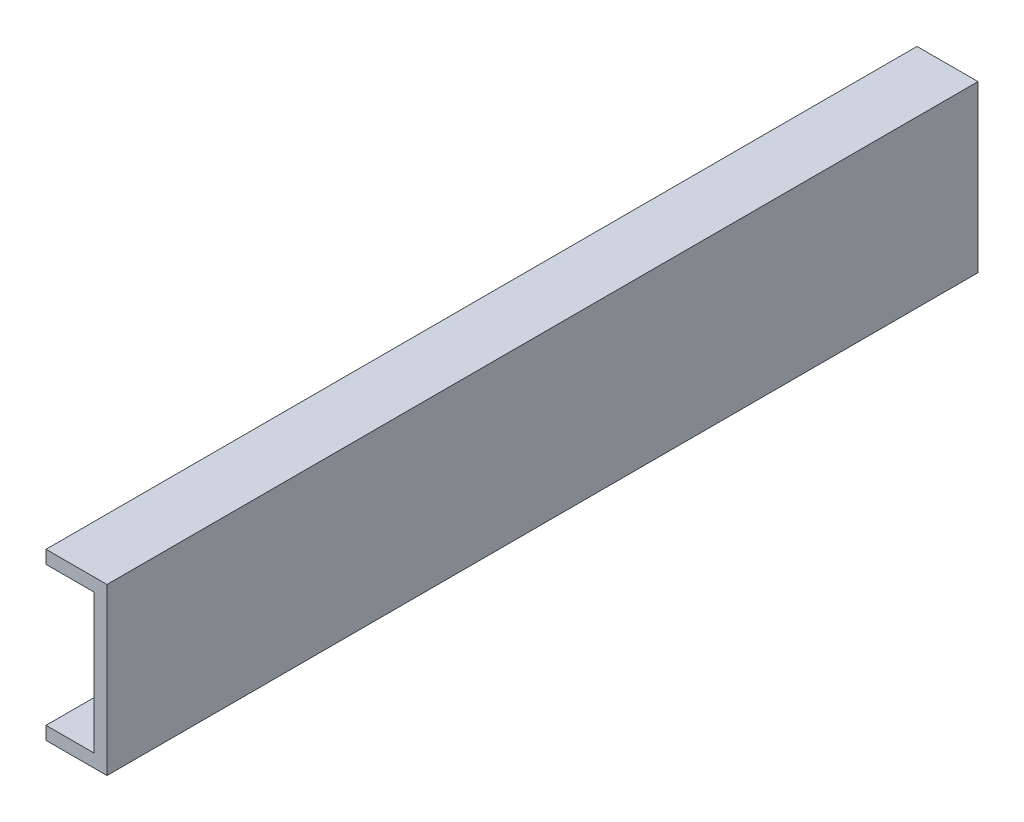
ISO-10303-21;
HEADER;
FILE_DESCRIPTION(('STEP AP214'),'2;1');
FILE_NAME('part.step','',(''),(''),'','','');
FILE_SCHEMA(('AUTOMOTIVE_DESIGN { 1 0 10303 214 1 1 1 1 }'));
ENDSEC;
DATA;
#1=APPLICATION_CONTEXT('core data for automotive mechanical design processes');
#2=APPLICATION_PROTOCOL_DEFINITION('international standard','automotive_design',2000,#1);
#3=PRODUCT_CONTEXT('',#1,'mechanical');
#4=PRODUCT('Part','Part','',(#3));
#5=PRODUCT_RELATED_PRODUCT_CATEGORY('part','',(#4));
#6=PRODUCT_DEFINITION_FORMATION('','',#4);
#7=PRODUCT_DEFINITION_CONTEXT('part definition',#1,'design');
#8=PRODUCT_DEFINITION('design','',#6,#7);
#9=PRODUCT_DEFINITION_SHAPE('','',#8);
#10=(LENGTH_UNIT() NAMED_UNIT(*) SI_UNIT(.MILLI.,.METRE.));
#11=(NAMED_UNIT(*) PLANE_ANGLE_UNIT() SI_UNIT($,.RADIAN.));
#12=(NAMED_UNIT(*) SI_UNIT($,.STERADIAN.) SOLID_ANGLE_UNIT());
#13=UNCERTAINTY_MEASURE_WITH_UNIT(LENGTH_MEASURE(1.E-05),#10,'distance_accuracy_value','');
#14=(GEOMETRIC_REPRESENTATION_CONTEXT(3) GLOBAL_UNCERTAINTY_ASSIGNED_CONTEXT((#13)) GLOBAL_UNIT_ASSIGNED_CONTEXT((#10,
#11,#12)) REPRESENTATION_CONTEXT('',''));
#15=CARTESIAN_POINT('',(0.,0.,0.));
#16=DIRECTION('',(0.,0.,1.));
#17=DIRECTION('',(1.,0.,0.));
#18=AXIS2_PLACEMENT_3D('',#15,#16,#17);
#19=CARTESIAN_POINT('',(0.,-16.,200.));
#20=DIRECTION('',(0.,-1.,0.));
#21=DIRECTION('',(0.,0.,-1.));
#22=AXIS2_PLACEMENT_3D('',#19,#20,#21);
#23=PLANE('',#22);
#24=DIRECTION('',(1.,0.,0.));
#25=VECTOR('',#24,1.);
#26=CARTESIAN_POINT('',(0.,-16.,0.));
#27=LINE('',#26,#25);
#28=CARTESIAN_POINT('',(-2.99999999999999,-16.,0.));
#29=VERTEX_POINT('',#28);
#30=CARTESIAN_POINT('',(-14.,-16.,0.));
#31=VERTEX_POINT('',#30);
#32=EDGE_CURVE('E99',#29,#31,#27,.F.);
#33=ORIENTED_EDGE('',*,*,#32,.T.);
#34=DIRECTION('',(0.,0.,-1.));
#35=VECTOR('',#34,1.);
#36=CARTESIAN_POINT('',(-14.,-16.,200.));
#37=LINE('',#36,#35);
#38=CARTESIAN_POINT('',(-14.,-16.,200.));
#39=VERTEX_POINT('',#38);
#40=EDGE_CURVE('E11',#39,#31,#37,.T.);
#41=ORIENTED_EDGE('',*,*,#40,.F.);
#42=DIRECTION('',(1.,0.,0.));
#43=VECTOR('',#42,1.);
#44=CARTESIAN_POINT('',(0.,-16.,200.));
#45=LINE('',#44,#43);
#46=CARTESIAN_POINT('',(-2.99999999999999,-16.,200.));
#47=VERTEX_POINT('',#46);
#48=EDGE_CURVE('E123',#47,#39,#45,.F.);
#49=ORIENTED_EDGE('',*,*,#48,.F.);
#50=DIRECTION('',(0.,0.,-1.));
#51=VECTOR('',#50,1.);
#52=CARTESIAN_POINT('',(-2.99999999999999,-16.,200.));
#53=LINE('',#52,#51);
#54=EDGE_CURVE('E100',#47,#29,#53,.T.);
#55=ORIENTED_EDGE('',*,*,#54,.T.);
#56=EDGE_LOOP('',(#33,#41,#49,#55));
#57=FACE_BOUND('',#56,.T.);
#58=ADVANCED_FACE('F24',(#57),#23,.F.);
#59=CARTESIAN_POINT('',(-14.,-19.,200.));
#60=DIRECTION('',(-1.,0.,0.));
#61=DIRECTION('',(0.,0.,1.));
#62=AXIS2_PLACEMENT_3D('',#59,#60,#61);
#63=PLANE('',#62);
#64=DIRECTION('',(0.,1.,0.));
#65=VECTOR('',#64,1.);
#66=CARTESIAN_POINT('',(-14.,-19.,0.));
#67=LINE('',#66,#65);
#68=CARTESIAN_POINT('',(-14.,-19.,0.));
#69=VERTEX_POINT('',#68);
#70=EDGE_CURVE('E91',#69,#31,#67,.T.);
#71=ORIENTED_EDGE('',*,*,#70,.F.);
#72=DIRECTION('',(0.,0.,-1.));
#73=VECTOR('',#72,1.);
#74=CARTESIAN_POINT('',(-14.,-19.,200.));
#75=LINE('',#74,#73);
#76=CARTESIAN_POINT('',(-14.,-19.,200.));
#77=VERTEX_POINT('',#76);
#78=EDGE_CURVE('E31',#77,#69,#75,.T.);
#79=ORIENTED_EDGE('',*,*,#78,.F.);
#80=DIRECTION('',(0.,1.,0.));
#81=VECTOR('',#80,1.);
#82=CARTESIAN_POINT('',(-14.,-19.,200.));
#83=LINE('',#82,#81);
#84=EDGE_CURVE('E94',#77,#39,#83,.T.);
#85=ORIENTED_EDGE('',*,*,#84,.T.);
#86=ORIENTED_EDGE('',*,*,#40,.T.);
#87=EDGE_LOOP('',(#71,#79,#85,#86));
#88=FACE_BOUND('',#87,.T.);
#89=ADVANCED_FACE('F89',(#88),#63,.T.);
#90=CARTESIAN_POINT('',(0.,-19.,200.));
#91=DIRECTION('',(0.,-1.,0.));
#92=DIRECTION('',(0.,0.,-1.));
#93=AXIS2_PLACEMENT_3D('',#90,#91,#92);
#94=PLANE('',#93);
#95=DIRECTION('',(-1.,0.,0.));
#96=VECTOR('',#95,1.);
#97=CARTESIAN_POINT('',(0.,-19.,0.));
#98=LINE('',#97,#96);
#99=CARTESIAN_POINT('',(0.,-19.,0.));
#100=VERTEX_POINT('',#99);
#101=EDGE_CURVE('E107',#100,#69,#98,.T.);
#102=ORIENTED_EDGE('',*,*,#101,.F.);
#103=DIRECTION('',(0.,0.,-1.));
#104=VECTOR('',#103,1.);
#105=CARTESIAN_POINT('',(0.,-19.,200.));
#106=LINE('',#105,#104);
#107=CARTESIAN_POINT('',(0.,-19.,200.));
#108=VERTEX_POINT('',#107);
#109=EDGE_CURVE('E150',#108,#100,#106,.T.);
#110=ORIENTED_EDGE('',*,*,#109,.F.);
#111=DIRECTION('',(-1.,0.,0.));
#112=VECTOR('',#111,1.);
#113=CARTESIAN_POINT('',(0.,-19.,200.));
#114=LINE('',#113,#112);
#115=EDGE_CURVE('E126',#108,#77,#114,.T.);
#116=ORIENTED_EDGE('',*,*,#115,.T.);
#117=ORIENTED_EDGE('',*,*,#78,.T.);
#118=EDGE_LOOP('',(#102,#110,#116,#117));
#119=FACE_BOUND('',#118,.T.);
#120=ADVANCED_FACE('F152',(#119),#94,.T.);
#121=CARTESIAN_POINT('',(0.,19.,200.));
#122=DIRECTION('',(1.,0.,0.));
#123=DIRECTION('',(0.,0.,-1.));
#124=AXIS2_PLACEMENT_3D('',#121,#122,#123);
#125=PLANE('',#124);
#126=DIRECTION('',(0.,-1.,0.));
#127=VECTOR('',#126,1.);
#128=CARTESIAN_POINT('',(0.,19.,0.));
#129=LINE('',#128,#127);
#130=CARTESIAN_POINT('',(0.,19.,0.));
#131=VERTEX_POINT('',#130);
#132=EDGE_CURVE('E109',#131,#100,#129,.T.);
#133=ORIENTED_EDGE('',*,*,#132,.F.);
#134=DIRECTION('',(0.,0.,-1.));
#135=VECTOR('',#134,1.);
#136=CARTESIAN_POINT('',(0.,19.,200.));
#137=LINE('',#136,#135);
#138=CARTESIAN_POINT('',(0.,19.,200.));
#139=VERTEX_POINT('',#138);
#140=EDGE_CURVE('E148',#139,#131,#137,.T.);
#141=ORIENTED_EDGE('',*,*,#140,.F.);
#142=DIRECTION('',(0.,-1.,0.));
#143=VECTOR('',#142,1.);
#144=CARTESIAN_POINT('',(0.,19.,200.));
#145=LINE('',#144,#143);
#146=EDGE_CURVE('E129',#139,#108,#145,.T.);
#147=ORIENTED_EDGE('',*,*,#146,.T.);
#148=ORIENTED_EDGE('',*,*,#109,.T.);
#149=EDGE_LOOP('',(#133,#141,#147,#148));
#150=FACE_BOUND('',#149,.T.);
#151=ADVANCED_FACE('F159',(#150),#125,.T.);
#152=CARTESIAN_POINT('',(-14.,19.,200.));
#153=DIRECTION('',(0.,1.,0.));
#154=DIRECTION('',(0.,0.,1.));
#155=AXIS2_PLACEMENT_3D('',#152,#153,#154);
#156=PLANE('',#155);
#157=DIRECTION('',(1.,0.,0.));
#158=VECTOR('',#157,1.);
#159=CARTESIAN_POINT('',(-14.,19.,0.));
#160=LINE('',#159,#158);
#161=CARTESIAN_POINT('',(-14.,19.,0.));
#162=VERTEX_POINT('',#161);
#163=EDGE_CURVE('E113',#162,#131,#160,.T.);
#164=ORIENTED_EDGE('',*,*,#163,.F.);
#165=DIRECTION('',(0.,0.,-1.));
#166=VECTOR('',#165,1.);
#167=CARTESIAN_POINT('',(-14.,19.,200.));
#168=LINE('',#167,#166);
#169=CARTESIAN_POINT('',(-14.,19.,200.));
#170=VERTEX_POINT('',#169);
#171=EDGE_CURVE('E146',#170,#162,#168,.T.);
#172=ORIENTED_EDGE('',*,*,#171,.F.);
#173=DIRECTION('',(1.,0.,0.));
#174=VECTOR('',#173,1.);
#175=CARTESIAN_POINT('',(-14.,19.,200.));
#176=LINE('',#175,#174);
#177=EDGE_CURVE('E132',#170,#139,#176,.T.);
#178=ORIENTED_EDGE('',*,*,#177,.T.);
#179=ORIENTED_EDGE('',*,*,#140,.T.);
#180=EDGE_LOOP('',(#164,#172,#178,#179));
#181=FACE_BOUND('',#180,.T.);
#182=ADVANCED_FACE('F162',(#181),#156,.T.);
#183=CARTESIAN_POINT('',(-14.,16.,200.));
#184=DIRECTION('',(-1.,0.,0.));
#185=DIRECTION('',(0.,0.,1.));
#186=AXIS2_PLACEMENT_3D('',#183,#184,#185);
#187=PLANE('',#186);
#188=DIRECTION('',(0.,1.,0.));
#189=VECTOR('',#188,1.);
#190=CARTESIAN_POINT('',(-14.,16.,0.));
#191=LINE('',#190,#189);
#192=CARTESIAN_POINT('',(-14.,16.,0.));
#193=VERTEX_POINT('',#192);
#194=EDGE_CURVE('E116',#193,#162,#191,.T.);
#195=ORIENTED_EDGE('',*,*,#194,.F.);
#196=DIRECTION('',(0.,0.,-1.));
#197=VECTOR('',#196,1.);
#198=CARTESIAN_POINT('',(-14.,16.,200.));
#199=LINE('',#198,#197);
#200=CARTESIAN_POINT('',(-14.,16.,200.));
#201=VERTEX_POINT('',#200);
#202=EDGE_CURVE('E144',#201,#193,#199,.T.);
#203=ORIENTED_EDGE('',*,*,#202,.F.);
#204=DIRECTION('',(0.,1.,0.));
#205=VECTOR('',#204,1.);
#206=CARTESIAN_POINT('',(-14.,16.,200.));
#207=LINE('',#206,#205);
#208=EDGE_CURVE('E135',#201,#170,#207,.T.);
#209=ORIENTED_EDGE('',*,*,#208,.T.);
#210=ORIENTED_EDGE('',*,*,#171,.T.);
#211=EDGE_LOOP('',(#195,#203,#209,#210));
#212=FACE_BOUND('',#211,.T.);
#213=ADVANCED_FACE('F165',(#212),#187,.T.);
#214=CARTESIAN_POINT('',(-14.,16.,200.));
#215=DIRECTION('',(0.,1.,0.));
#216=DIRECTION('',(0.,0.,1.));
#217=AXIS2_PLACEMENT_3D('',#214,#215,#216);
#218=PLANE('',#217);
#219=DIRECTION('',(1.,0.,0.));
#220=VECTOR('',#219,1.);
#221=CARTESIAN_POINT('',(-14.,16.,0.));
#222=LINE('',#221,#220);
#223=CARTESIAN_POINT('',(-2.99999999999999,16.,0.));
#224=VERTEX_POINT('',#223);
#225=EDGE_CURVE('E119',#193,#224,#222,.T.);
#226=ORIENTED_EDGE('',*,*,#225,.T.);
#227=DIRECTION('',(0.,0.,-1.));
#228=VECTOR('',#227,1.);
#229=CARTESIAN_POINT('',(-2.99999999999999,16.,200.));
#230=LINE('',#229,#228);
#231=CARTESIAN_POINT('',(-2.99999999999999,16.,200.));
#232=VERTEX_POINT('',#231);
#233=EDGE_CURVE('E141',#232,#224,#230,.T.);
#234=ORIENTED_EDGE('',*,*,#233,.F.);
#235=DIRECTION('',(1.,0.,0.));
#236=VECTOR('',#235,1.);
#237=CARTESIAN_POINT('',(-14.,16.,200.));
#238=LINE('',#237,#236);
#239=EDGE_CURVE('E43',#201,#232,#238,.T.);
#240=ORIENTED_EDGE('',*,*,#239,.F.);
#241=ORIENTED_EDGE('',*,*,#202,.T.);
#242=EDGE_LOOP('',(#226,#234,#240,#241));
#243=FACE_BOUND('',#242,.T.);
#244=ADVANCED_FACE('F168',(#243),#218,.F.);
#245=CARTESIAN_POINT('',(-2.99999999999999,19.,200.));
#246=DIRECTION('',(1.,0.,0.));
#247=DIRECTION('',(0.,0.,-1.));
#248=AXIS2_PLACEMENT_3D('',#245,#246,#247);
#249=PLANE('',#248);
#250=DIRECTION('',(0.,1.,0.));
#251=VECTOR('',#250,1.);
#252=CARTESIAN_POINT('',(-2.99999999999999,19.,0.));
#253=LINE('',#252,#251);
#254=EDGE_CURVE('E121',#224,#29,#253,.F.);
#255=ORIENTED_EDGE('',*,*,#254,.T.);
#256=ORIENTED_EDGE('',*,*,#54,.F.);
#257=DIRECTION('',(0.,1.,0.));
#258=VECTOR('',#257,1.);
#259=CARTESIAN_POINT('',(-2.99999999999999,19.,200.));
#260=LINE('',#259,#258);
#261=EDGE_CURVE('E38',#232,#47,#260,.F.);
#262=ORIENTED_EDGE('',*,*,#261,.F.);
#263=ORIENTED_EDGE('',*,*,#233,.T.);
#264=EDGE_LOOP('',(#255,#256,#262,#263));
#265=FACE_BOUND('',#264,.T.);
#266=ADVANCED_FACE('F170',(#265),#249,.F.);
#267=CARTESIAN_POINT('',(-14.,-16.,200.));
#268=DIRECTION('',(0.,0.,1.));
#269=DIRECTION('',(1.,0.,0.));
#270=AXIS2_PLACEMENT_3D('',#267,#268,#269);
#271=PLANE('',#270);
#272=ORIENTED_EDGE('',*,*,#48,.T.);
#273=ORIENTED_EDGE('',*,*,#84,.F.);
#274=ORIENTED_EDGE('',*,*,#115,.F.);
#275=ORIENTED_EDGE('',*,*,#146,.F.);
#276=ORIENTED_EDGE('',*,*,#177,.F.);
#277=ORIENTED_EDGE('',*,*,#208,.F.);
#278=ORIENTED_EDGE('',*,*,#239,.T.);
#279=ORIENTED_EDGE('',*,*,#261,.T.);
#280=EDGE_LOOP('',(#272,#273,#274,#275,#276,#277,#278,#279));
#281=FACE_BOUND('',#280,.T.);
#282=ADVANCED_FACE('F154',(#281),#271,.T.);
#283=CARTESIAN_POINT('',(-14.,-16.,0.));
#284=DIRECTION('',(0.,0.,1.));
#285=DIRECTION('',(1.,0.,0.));
#286=AXIS2_PLACEMENT_3D('',#283,#284,#285);
#287=PLANE('',#286);
#288=ORIENTED_EDGE('',*,*,#32,.F.);
#289=ORIENTED_EDGE('',*,*,#254,.F.);
#290=ORIENTED_EDGE('',*,*,#225,.F.);
#291=ORIENTED_EDGE('',*,*,#194,.T.);
#292=ORIENTED_EDGE('',*,*,#163,.T.);
#293=ORIENTED_EDGE('',*,*,#132,.T.);
#294=ORIENTED_EDGE('',*,*,#101,.T.);
#295=ORIENTED_EDGE('',*,*,#70,.T.);
#296=EDGE_LOOP('',(#288,#289,#290,#291,#292,#293,#294,#295));
#297=FACE_BOUND('',#296,.T.);
#298=ADVANCED_FACE('F104',(#297),#287,.F.);
#299=CLOSED_SHELL('',(#58,#89,#120,#151,#182,#213,#244,#266,#282,#298));
#300=MANIFOLD_SOLID_BREP('B2',#299);
#301=ADVANCED_BREP_SHAPE_REPRESENTATION('',(#18,#300),#14);
#302=SHAPE_DEFINITION_REPRESENTATION(#9,#301);
ENDSEC;
END-ISO-10303-21;
